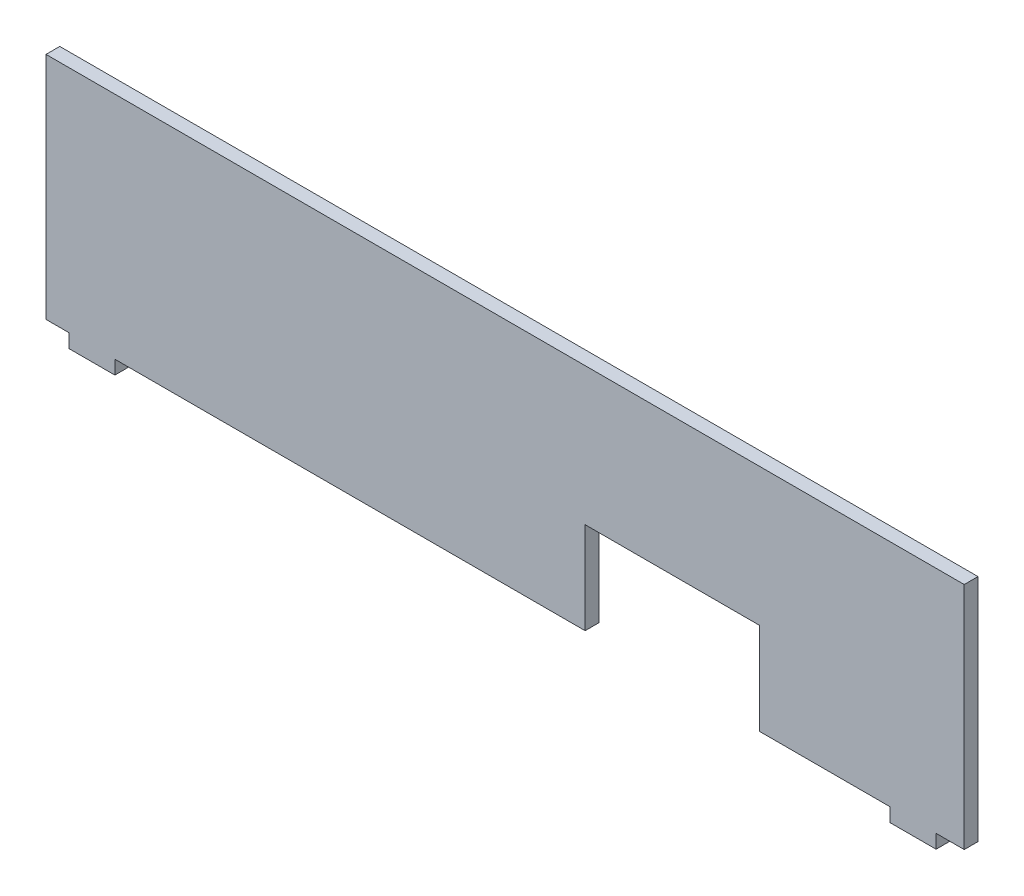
from build123d import *

# Parameters (mm, degrees)
RESSALTO_EXTRUS_O2_DEPTH = 3


with BuildPart() as part:
    # Esbo_o2 → Ressalto-extrus_o2 (new body)
    with BuildSketch(Plane.XY):
        Polygon((-62.490658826, 33.134581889), (137.509341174, 33.134581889), (137.509341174, -16.865418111), (131.379341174, -16.865418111), (131.379341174, -19.865418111), (121.379341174, -19.865418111), (121.379341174, -16.865418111), (92.93973475, -16.865418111), (92.93973475, 3.134581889), (54.93973475, 3.134581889), (54.93973475, -16.865418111), (-47.490658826, -16.865418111), (-47.490658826, -19.865418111), (-57.490658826, -19.865418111), (-57.490658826, -16.865418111), (-62.490658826, -16.865418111), align=None)
    extrude(amount=RESSALTO_EXTRUS_O2_DEPTH)


solid = part.part
